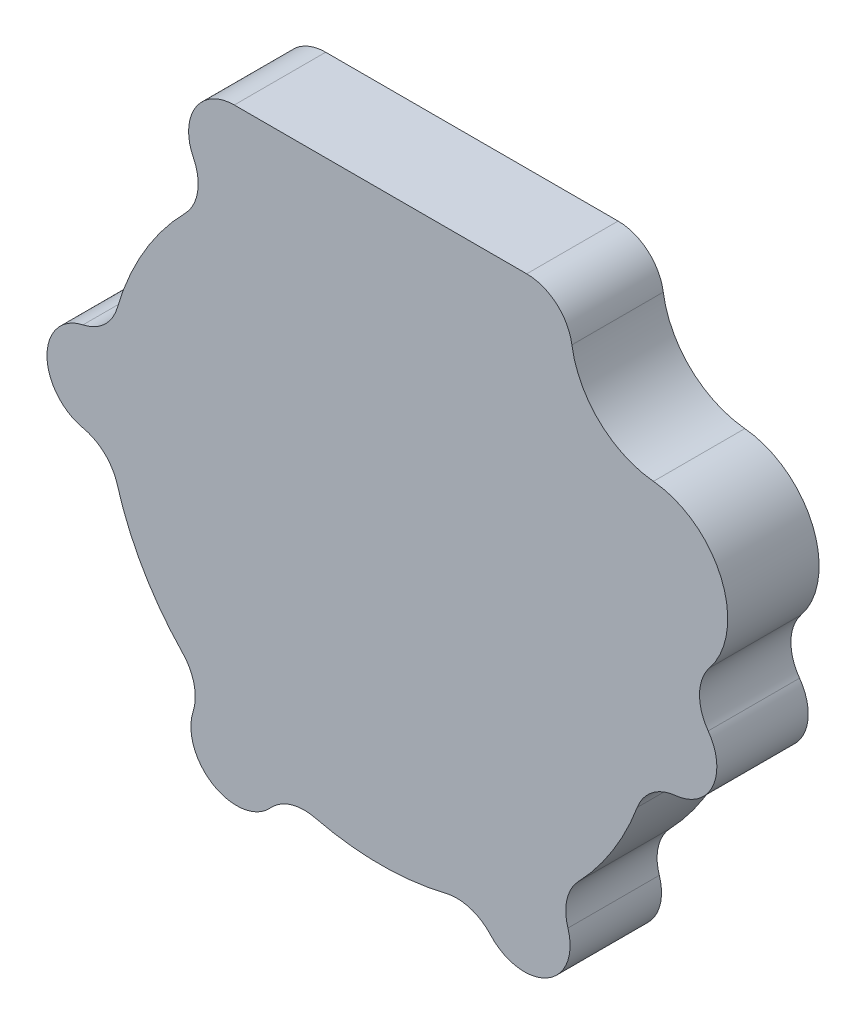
from build123d import *

# Parameters (mm, degrees)
BOSS_EXTRU_1_DEPTH = 10


with BuildPart() as part:
    # Esquisse1 → Boss.-Extru.1 (new body)
    with BuildSketch(Plane.XY):
        with BuildLine():
            Line((5.173067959, 0), (-10.826932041, 0))
            ThreePointArc((-10.826932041, 0), (-15.077866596, -2.367595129), (-15.303004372, -7.228177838))
            ThreePointArc((-15.303004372, -7.228177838), (-14.841066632, -10.241248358), (-16.21448461, -12.96259058))
            ThreePointArc((-16.21448461, -12.96259058), (-20.709555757, -18.831289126), (-23.633054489, -25.621019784))
            ThreePointArc((-23.633054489, -25.621019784), (-25.025812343, -27.882903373), (-27.380503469, -29.112261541))
            ThreePointArc((-27.380503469, -29.112261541), (-31.326932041, -34), (-27.380503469, -38.887738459))
            ThreePointArc((-27.380503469, -38.887738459), (-25.025812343, -40.117096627), (-23.633054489, -42.378980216))
            ThreePointArc((-23.633054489, -42.378980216), (-20.807694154, -49), (-16.48640299, -54.757343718))
            ThreePointArc((-16.48640299, -54.757343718), (-15.223933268, -57.094449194), (-15.336623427, -59.748350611))
            ThreePointArc((-15.336623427, -59.748350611), (-13.076932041, -65.609927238), (-6.870812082, -64.636089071))
            ThreePointArc((-6.870812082, -64.636089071), (-4.628811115, -63.211545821), (-1.97358354, -63.136323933))
            ThreePointArc((-1.97358354, -63.136323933), (5.173067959, -64), (12.319719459, -63.136323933))
            ThreePointArc((12.319719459, -63.136323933), (14.974947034, -63.211545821), (17.216948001, -64.636089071))
            ThreePointArc((17.216948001, -64.636089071), (23.423067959, -65.609927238), (25.682759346, -59.748350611))
            ThreePointArc((25.682759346, -59.748350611), (25.570069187, -57.094449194), (26.832538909, -54.757343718))
            ThreePointArc((26.832538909, -54.757343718), (30.57169684, -49.965890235), (33.268401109, -44.51913757))
            ThreePointArc((33.268401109, -44.51913757), (34.905445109, -42.306868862), (37.465162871, -41.295982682))
            ThreePointArc((37.465162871, -41.295982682), (41.537180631, -38.375448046), (41.031177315, -33.389988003))
            ThreePointArc((41.031177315, -33.389988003), (40.084597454, -30.333386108), (41.185123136, -27.328777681))
            ThreePointArc((41.185123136, -27.328777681), (42.463702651, -18.199488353), (35.040116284, -12.734229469))
            ThreePointArc((35.040116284, -12.734229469), (29.121464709, -10.032037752), (26.118063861, -4.260395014))
            ThreePointArc((26.118063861, -4.260395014), (24.436653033, -1.211990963), (21.173067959, 0))
            Line((21.173067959, 0), (5.173067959, 0))
        make_face()
    extrude(amount=BOSS_EXTRU_1_DEPTH)


solid = part.part
